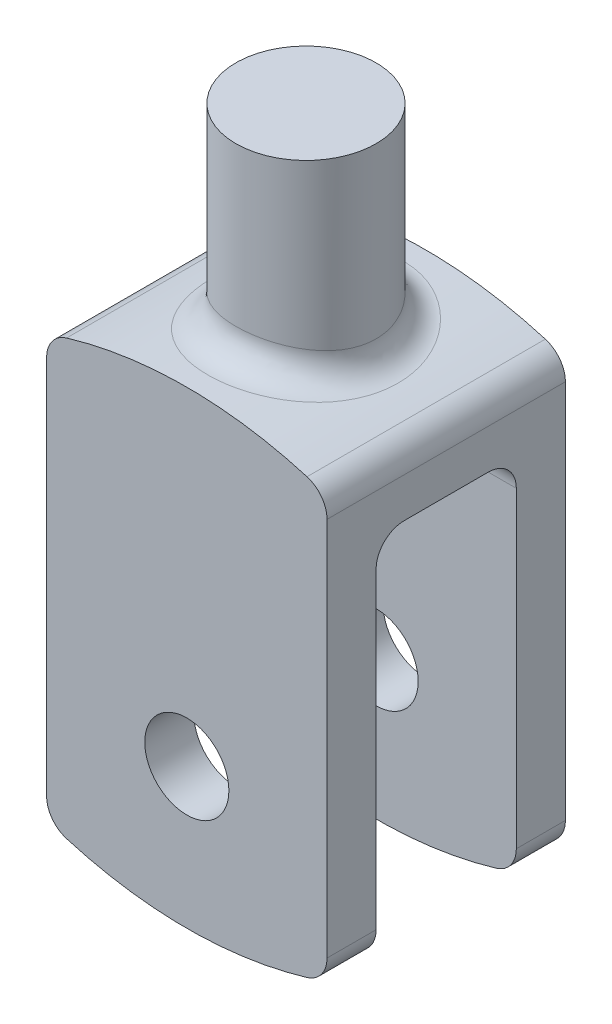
ISO-10303-21;
HEADER;
FILE_DESCRIPTION(('STEP AP214'),'2;1');
FILE_NAME('part.step','',(''),(''),'','','');
FILE_SCHEMA(('AUTOMOTIVE_DESIGN { 1 0 10303 214 1 1 1 1 }'));
ENDSEC;
DATA;
#1=APPLICATION_CONTEXT('core data for automotive mechanical design processes');
#2=APPLICATION_PROTOCOL_DEFINITION('international standard','automotive_design',2000,#1);
#3=PRODUCT_CONTEXT('',#1,'mechanical');
#4=PRODUCT('Part','Part','',(#3));
#5=PRODUCT_RELATED_PRODUCT_CATEGORY('part','',(#4));
#6=PRODUCT_DEFINITION_FORMATION('','',#4);
#7=PRODUCT_DEFINITION_CONTEXT('part definition',#1,'design');
#8=PRODUCT_DEFINITION('design','',#6,#7);
#9=PRODUCT_DEFINITION_SHAPE('','',#8);
#10=(LENGTH_UNIT() NAMED_UNIT(*) SI_UNIT(.MILLI.,.METRE.));
#11=(NAMED_UNIT(*) PLANE_ANGLE_UNIT() SI_UNIT($,.RADIAN.));
#12=(NAMED_UNIT(*) SI_UNIT($,.STERADIAN.) SOLID_ANGLE_UNIT());
#13=UNCERTAINTY_MEASURE_WITH_UNIT(LENGTH_MEASURE(1.E-05),#10,'distance_accuracy_value','');
#14=(GEOMETRIC_REPRESENTATION_CONTEXT(3) GLOBAL_UNCERTAINTY_ASSIGNED_CONTEXT((#13)) GLOBAL_UNIT_ASSIGNED_CONTEXT((#10,
#11,#12)) REPRESENTATION_CONTEXT('',''));
#15=CARTESIAN_POINT('',(0.,0.,0.));
#16=DIRECTION('',(0.,0.,1.));
#17=DIRECTION('',(1.,0.,0.));
#18=AXIS2_PLACEMENT_3D('',#15,#16,#17);
#19=CARTESIAN_POINT('',(0.,-21.2289755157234,10.795));
#20=DIRECTION('',(0.,0.,-1.));
#21=DIRECTION('',(-1.,0.,0.));
#22=AXIS2_PLACEMENT_3D('',#19,#20,#21);
#23=CYLINDRICAL_SURFACE('',#22,38.1);
#24=CARTESIAN_POINT('',(0.,-21.2289755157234,6.35));
#25=DIRECTION('',(0.,0.,1.));
#26=DIRECTION('',(0.,-1.,0.));
#27=AXIS2_PLACEMENT_3D('',#24,#25,#26);
#28=CIRCLE('',#27,38.1);
#29=CARTESIAN_POINT('',(-10.8857142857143,-57.7407712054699,6.34999999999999));
#30=VERTEX_POINT('',#29);
#31=CARTESIAN_POINT('',(10.8857142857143,-57.7407712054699,6.34999999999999));
#32=VERTEX_POINT('',#31);
#33=EDGE_CURVE('E177',#30,#32,#28,.T.);
#34=ORIENTED_EDGE('',*,*,#33,.T.);
#35=DIRECTION('',(0.,0.,-1.));
#36=VECTOR('',#35,1.);
#37=CARTESIAN_POINT('',(10.8857142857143,-57.7407712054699,10.795));
#38=LINE('',#37,#36);
#39=CARTESIAN_POINT('',(10.8857142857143,-57.7407712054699,10.795));
#40=VERTEX_POINT('',#39);
#41=EDGE_CURVE('E293',#32,#40,#38,.F.);
#42=ORIENTED_EDGE('',*,*,#41,.T.);
#43=CARTESIAN_POINT('',(0.,-21.2289755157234,10.795));
#44=DIRECTION('',(0.,0.,1.));
#45=DIRECTION('',(1.,0.,0.));
#46=AXIS2_PLACEMENT_3D('',#43,#44,#45);
#47=CIRCLE('',#46,38.1);
#48=CARTESIAN_POINT('',(-10.8857142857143,-57.7407712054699,10.795));
#49=VERTEX_POINT('',#48);
#50=EDGE_CURVE('E343',#49,#40,#47,.T.);
#51=ORIENTED_EDGE('',*,*,#50,.F.);
#52=DIRECTION('',(0.,0.,-1.));
#53=VECTOR('',#52,1.);
#54=CARTESIAN_POINT('',(-10.8857142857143,-57.7407712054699,10.795));
#55=LINE('',#54,#53);
#56=EDGE_CURVE('E291',#49,#30,#55,.T.);
#57=ORIENTED_EDGE('',*,*,#56,.T.);
#58=EDGE_LOOP('',(#34,#42,#51,#57));
#59=FACE_BOUND('',#58,.T.);
#60=ADVANCED_FACE('F34',(#59),#23,.T.);
#61=CARTESIAN_POINT('',(0.,-54.9710244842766,10.795));
#62=DIRECTION('',(0.,0.,-1.));
#63=DIRECTION('',(-1.,0.,0.));
#64=AXIS2_PLACEMENT_3D('',#61,#62,#63);
#65=CYLINDRICAL_SURFACE('',#64,38.1);
#66=CARTESIAN_POINT('',(-1.62684312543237,-14.3948956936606,6.1380682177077));
#67=CARTESIAN_POINT('',(-1.4957202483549,-16.8950073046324,6.17282122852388));
#68=CARTESIAN_POINT('',(-2.13523160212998,-16.9309037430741,8.59329550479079));
#69=CARTESIAN_POINT('',(-1.28311185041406,-14.3678855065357,6.22917093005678));
#70=CARTESIAN_POINT('',(-1.17403905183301,-16.884578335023,6.25020854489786));
#71=CARTESIAN_POINT('',(-1.68408430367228,-16.905581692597,8.72083930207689));
#72=CARTESIAN_POINT('',(-0.931399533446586,-14.3489130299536,6.29140632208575));
#73=CARTESIAN_POINT('',(-0.851006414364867,-16.8776047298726,6.30155523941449));
#74=CARTESIAN_POINT('',(-1.22246188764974,-16.8877949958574,8.80796885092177));
#75=CARTESIAN_POINT('',(-0.222279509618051,-14.3291852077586,6.35608452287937));
#76=CARTESIAN_POINT('',(-0.20202055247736,-16.8703306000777,6.35511063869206));
#77=CARTESIAN_POINT('',(-0.291741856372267,-16.8693001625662,8.89851833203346));
#78=CARTESIAN_POINT('',(0.13512749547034,-14.3284276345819,6.35853464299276));
#79=CARTESIAN_POINT('',(0.122611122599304,-16.8700589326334,6.3571068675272));
#80=CARTESIAN_POINT('',(0.177354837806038,-16.8685899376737,8.90194850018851));
#81=CARTESIAN_POINT('',(0.838574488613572,-14.3450529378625,6.30408536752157));
#82=CARTESIAN_POINT('',(0.765900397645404,-16.8761788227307,6.31205964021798));
#83=CARTESIAN_POINT('',(1.10062901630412,-16.8841761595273,8.82571951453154));
#84=CARTESIAN_POINT('',(1.18470291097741,-14.3621052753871,6.24826739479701));
#85=CARTESIAN_POINT('',(1.08327757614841,-16.8824248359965,6.2660873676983));
#86=CARTESIAN_POINT('',(1.55492257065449,-16.9001627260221,8.74757435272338));
#87=CARTESIAN_POINT('',(1.86253640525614,-14.4119790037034,6.0807363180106));
#88=CARTESIAN_POINT('',(1.71405910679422,-16.9015111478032,6.12464233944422));
#89=CARTESIAN_POINT('',(2.44457903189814,-16.9469193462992,8.51303084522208));
#90=CARTESIAN_POINT('',(2.19424101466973,-14.4448008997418,5.9690214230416));
#91=CARTESIAN_POINT('',(2.02640546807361,-16.9142827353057,6.02968223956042));
#92=CARTESIAN_POINT('',(2.87994133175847,-16.9776898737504,8.35662999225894));
#93=CARTESIAN_POINT('',(2.83587318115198,-14.5228916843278,5.69236591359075));
#94=CARTESIAN_POINT('',(2.64232534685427,-16.9462641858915,5.78748761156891));
#95=CARTESIAN_POINT('',(3.72208355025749,-17.0508999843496,7.96931227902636));
#96=CARTESIAN_POINT('',(3.14567891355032,-14.5682242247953,5.52715234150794));
#97=CARTESIAN_POINT('',(2.94516922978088,-16.965413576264,5.64072256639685));
#98=CARTESIAN_POINT('',(4.12870357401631,-17.0933992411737,7.73801327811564));
#99=CARTESIAN_POINT('',(3.73350247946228,-14.6664207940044,5.14837403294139));
#100=CARTESIAN_POINT('',(3.53132306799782,-17.0089969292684,5.2941314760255));
#101=CARTESIAN_POINT('',(4.90022200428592,-17.1854585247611,7.20772364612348));
#102=CARTESIAN_POINT('',(4.0115160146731,-14.7192858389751,4.93480277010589));
#103=CARTESIAN_POINT('',(3.81443129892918,-17.0333480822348,5.0950750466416));
#104=CARTESIAN_POINT('',(5.26511476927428,-17.2350195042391,6.90872387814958));
#105=CARTESIAN_POINT('',(4.53400993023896,-14.8280650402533,4.46009153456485));
#106=CARTESIAN_POINT('',(4.35579928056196,-17.0855786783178,4.64097369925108));
#107=CARTESIAN_POINT('',(5.95088803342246,-17.3370000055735,6.24412814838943));
#108=CARTESIAN_POINT('',(4.77766830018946,-14.884019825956,4.19805089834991));
#109=CARTESIAN_POINT('',(4.61377965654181,-17.1134889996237,4.38541327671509));
#110=CARTESIAN_POINT('',(6.27068964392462,-17.3894576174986,5.87727125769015));
#111=CARTESIAN_POINT('',(5.21779402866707,-14.9917051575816,3.63653478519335));
#112=CARTESIAN_POINT('',(5.08607964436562,-17.1689332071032,3.82607928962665));
#113=CARTESIAN_POINT('',(6.84835466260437,-17.4904126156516,5.09114869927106));
#114=CARTESIAN_POINT('',(5.41425931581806,-15.0434355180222,3.33705766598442));
#115=CARTESIAN_POINT('',(5.30109492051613,-17.1964995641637,3.52251692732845));
#116=CARTESIAN_POINT('',(7.10621535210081,-17.5389098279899,4.67188073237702));
#117=CARTESIAN_POINT('',(5.75528848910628,-15.1370239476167,2.70704732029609));
#118=CARTESIAN_POINT('',(5.67746421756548,-17.2474027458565,2.87432718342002));
#119=CARTESIAN_POINT('',(7.55381614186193,-17.6266489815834,3.7898662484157));
#120=CARTESIAN_POINT('',(5.89957361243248,-15.1788285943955,2.37635885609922));
#121=CARTESIAN_POINT('',(5.83941099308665,-17.2708089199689,2.52915588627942));
#122=CARTESIAN_POINT('',(7.74319036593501,-17.6658408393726,3.32690239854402));
#123=CARTESIAN_POINT('',(6.1302689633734,-15.2472291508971,1.6946223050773));
#124=CARTESIAN_POINT('',(6.09920172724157,-17.3094878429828,1.81125495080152));
#125=CARTESIAN_POINT('',(8.04597801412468,-17.7299663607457,2.37247122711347));
#126=CARTESIAN_POINT('',(6.21668791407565,-15.2738273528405,1.34357729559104));
#127=CARTESIAN_POINT('',(6.19782695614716,-17.3248678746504,1.43767778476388));
#128=CARTESIAN_POINT('',(8.15940288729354,-17.7549021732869,1.88100821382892));
#129=CARTESIAN_POINT('',(6.32770988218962,-15.3082251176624,0.638374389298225));
#130=CARTESIAN_POINT('',(6.32434369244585,-17.3447650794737,0.684883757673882));
#131=CARTESIAN_POINT('',(8.30511922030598,-17.7871500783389,0.893724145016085));
#132=CARTESIAN_POINT('',(6.35347907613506,-15.3163792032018,0.284408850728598));
#133=CARTESIAN_POINT('',(6.35397829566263,-17.3495505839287,0.304766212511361));
#134=CARTESIAN_POINT('',(8.33894128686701,-17.7947945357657,0.398172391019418));
#135=CARTESIAN_POINT('',(6.34576662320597,-15.3139584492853,-0.422823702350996));
#136=CARTESIAN_POINT('',(6.34515813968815,-17.3481408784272,-0.453200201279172));
#137=CARTESIAN_POINT('',(8.32881869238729,-17.7925250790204,-0.591953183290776));
#138=CARTESIAN_POINT('',(6.31228993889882,-15.3033851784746,-0.776090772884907));
#139=CARTESIAN_POINT('',(6.30667936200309,-17.341941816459,-0.832326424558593));
#140=CARTESIAN_POINT('',(8.28488054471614,-17.7826126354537,-1.08652708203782));
#141=CARTESIAN_POINT('',(6.1880838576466,-15.2650529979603,-1.4668264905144));
#142=CARTESIAN_POINT('',(6.16529913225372,-17.31981501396,-1.5687562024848));
#143=CARTESIAN_POINT('',(8.12186006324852,-17.7466762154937,-2.0535570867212));
#144=CARTESIAN_POINT('',(6.0981515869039,-15.2375334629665,-1.80444594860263));
#145=CARTESIAN_POINT('',(6.06285035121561,-17.3039544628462,-1.92739477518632));
#146=CARTESIAN_POINT('',(8.00382395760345,-17.7208766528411,-2.52622432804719));
#147=CARTESIAN_POINT('',(5.86455796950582,-15.1686756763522,-2.45977497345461));
#148=CARTESIAN_POINT('',(5.80019918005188,-17.2651311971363,-2.61625695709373));
#149=CARTESIAN_POINT('',(7.69723233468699,-17.6563224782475,-3.44368496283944));
#150=CARTESIAN_POINT('',(5.72089305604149,-15.1273365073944,-2.77748321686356));
#151=CARTESIAN_POINT('',(5.63927681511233,-17.2420713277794,-2.94720684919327));
#152=CARTESIAN_POINT('',(7.50867213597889,-17.6175670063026,-3.88847650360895));
#153=CARTESIAN_POINT('',(5.38169706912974,-15.0348021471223,-3.3887567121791));
#154=CARTESIAN_POINT('',(5.2654646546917,-17.1918848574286,-3.57507096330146));
#155=CARTESIAN_POINT('',(7.06347740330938,-17.5308160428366,-4.74425939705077));
#156=CARTESIAN_POINT('',(5.18549065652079,-14.9834811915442,-3.68193722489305));
#157=CARTESIAN_POINT('',(5.05110760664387,-17.164627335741,-3.87169541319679));
#158=CARTESIAN_POINT('',(6.80595648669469,-17.4827026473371,-5.15471211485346));
#159=CARTESIAN_POINT('',(4.74750174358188,-14.8770074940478,-4.23170049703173));
#160=CARTESIAN_POINT('',(4.58180259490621,-17.1099680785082,-4.418377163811));
#161=CARTESIAN_POINT('',(6.23109603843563,-17.3828835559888,-5.92438069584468));
#162=CARTESIAN_POINT('',(4.50570710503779,-14.8218537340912,-4.48827347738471));
#163=CARTESIAN_POINT('',(4.32619077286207,-17.0825384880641,-4.66819493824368));
#164=CARTESIAN_POINT('',(5.91374057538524,-17.3311769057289,-6.28358286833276));
#165=CARTESIAN_POINT('',(3.97766330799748,-14.7125960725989,-4.96278342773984));
#166=CARTESIAN_POINT('',(3.77962543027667,-17.0301988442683,-5.12155272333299));
#167=CARTESIAN_POINT('',(5.22068309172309,-17.2287478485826,-6.94789679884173));
#168=CARTESIAN_POINT('',(3.69061926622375,-14.658535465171,-5.17984151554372));
#169=CARTESIAN_POINT('',(3.48783646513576,-17.0053972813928,-5.32337226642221));
#170=CARTESIAN_POINT('',(4.84393778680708,-17.1780660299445,-7.2517781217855));
#171=CARTESIAN_POINT('',(3.08362598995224,-14.5587142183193,-5.5625791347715));
#172=CARTESIAN_POINT('',(2.88399037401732,-16.9613054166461,-5.67265081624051));
#173=CARTESIAN_POINT('',(4.04725911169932,-17.0844836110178,-7.78761078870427));
#174=CARTESIAN_POINT('',(2.76370108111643,-14.5129475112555,-5.72829628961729));
#175=CARTESIAN_POINT('',(2.57219385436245,-16.9421030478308,-5.81930777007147));
#176=CARTESIAN_POINT('',(3.62735766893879,-17.0415773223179,-8.01961480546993));
#177=CARTESIAN_POINT('',(2.16993709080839,-14.4430536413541,-5.97447646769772));
#178=CARTESIAN_POINT('',(2.00439305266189,-16.913688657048,-6.03386817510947));
#179=CARTESIAN_POINT('',(2.84804243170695,-16.9760518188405,-8.36426705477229));
#180=CARTESIAN_POINT('',(1.90059279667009,-14.4163987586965,-6.06554598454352));
#181=CARTESIAN_POINT('',(1.75051482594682,-16.9032608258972,-6.11156128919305));
#182=CARTESIAN_POINT('',(2.49452804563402,-16.9510628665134,-8.4917643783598));
#183=CARTESIAN_POINT('',(1.35176063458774,-14.3732879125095,-6.21094362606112));
#184=CARTESIAN_POINT('',(1.23846006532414,-16.886673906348,-6.2346740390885));
#185=CARTESIAN_POINT('',(1.77418583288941,-16.9106464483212,-8.69532107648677));
#186=CARTESIAN_POINT('',(1.07227335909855,-14.3568313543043,-6.26527389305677));
#187=CARTESIAN_POINT('',(0.980833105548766,-16.8805534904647,-6.27980384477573));
#188=CARTESIAN_POINT('',(1.40735878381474,-16.8952184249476,-8.77138345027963));
#189=CARTESIAN_POINT('',(0.442660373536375,-14.3328435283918,-6.34421767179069));
#190=CARTESIAN_POINT('',(0.403036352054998,-16.8716518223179,-6.34540443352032));
#191=CARTESIAN_POINT('',(0.580991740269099,-16.87272983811,-8.88190474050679));
#192=CARTESIAN_POINT('',(0.0911985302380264,-14.3282711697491,-6.35900438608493));
#193=CARTESIAN_POINT('',(0.0835434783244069,-16.870012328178,-6.3574476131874));
#194=CARTESIAN_POINT('',(0.119698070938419,-16.8684432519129,-8.90260614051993));
#195=CARTESIAN_POINT('',(-0.60937489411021,-14.337015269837,-6.3304200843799));
#196=CARTESIAN_POINT('',(-0.55615695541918,-16.8732209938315,-6.33383619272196));
#197=CARTESIAN_POINT('',(-0.799804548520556,-16.8766408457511,-8.86258811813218));
#198=CARTESIAN_POINT('',(-0.958484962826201,-14.3503423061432,-6.28701468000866));
#199=CARTESIAN_POINT('',(-0.875077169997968,-16.8780601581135,-6.29824777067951));
#200=CARTESIAN_POINT('',(-1.25801151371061,-16.8891349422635,-8.80182055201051));
#201=CARTESIAN_POINT('',(-1.64401986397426,-14.3934107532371,-6.1434707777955));
#202=CARTESIAN_POINT('',(-1.5097350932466,-16.8943539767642,-6.17778507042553));
#203=CARTESIAN_POINT('',(-2.15777607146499,-16.9295116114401,-8.60085908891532));
#204=CARTESIAN_POINT('',(-1.98045393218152,-14.4231399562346,-6.04337447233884));
#205=CARTESIAN_POINT('',(-1.82434704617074,-16.9057428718,-6.09339903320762));
#206=CARTESIAN_POINT('',(-2.59934578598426,-16.957382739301,-8.46072426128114));
#207=CARTESIAN_POINT('',(-2.63162249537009,-14.4957842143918,-5.78957744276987));
#208=CARTESIAN_POINT('',(-2.44476217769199,-16.9350164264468,-5.873144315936));
#209=CARTESIAN_POINT('',(-3.45400452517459,-17.0254867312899,-8.10540841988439));
#210=CARTESIAN_POINT('',(-2.94635733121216,-14.538699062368,-5.63587756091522));
#211=CARTESIAN_POINT('',(-2.74978639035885,-16.9528099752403,-5.73798166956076));
#212=CARTESIAN_POINT('',(-3.8670939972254,-17.0657194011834,-7.89022858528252));
#213=CARTESIAN_POINT('',(-3.54910042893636,-14.6336518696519,-5.27737322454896));
#214=CARTESIAN_POINT('',(-3.34571445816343,-16.9942129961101,-5.41316926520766));
#215=CARTESIAN_POINT('',(-4.65819431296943,-17.1547376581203,-7.38832251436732));
#216=CARTESIAN_POINT('',(-3.83678348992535,-14.6857833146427,-5.07203499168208));
#217=CARTESIAN_POINT('',(-3.63614701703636,-17.0177944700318,-5.2237329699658));
#218=CARTESIAN_POINT('',(-5.03577833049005,-17.2036108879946,-7.10084898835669));
#219=CARTESIAN_POINT('',(-4.37404121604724,-14.7932317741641,-4.61673983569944));
#220=CARTESIAN_POINT('',(-4.1885367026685,-17.0685807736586,-4.79207999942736));
#221=CARTESIAN_POINT('',(-5.74092909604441,-17.304343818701,-6.46343576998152));
#222=CARTESIAN_POINT('',(-4.62361089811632,-14.8485492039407,-4.36677708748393));
#223=CARTESIAN_POINT('',(-4.450686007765,-17.095736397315,-4.55051709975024));
#224=CARTESIAN_POINT('',(-6.0684893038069,-17.3562039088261,-6.11348792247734));
#225=CARTESIAN_POINT('',(-5.08225498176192,-14.9573722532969,-3.82384001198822));
#226=CARTESIAN_POINT('',(-4.93934427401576,-17.1509844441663,-4.01413593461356));
#227=CARTESIAN_POINT('',(-6.67045966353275,-17.4582255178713,-5.35337601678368));
#228=CARTESIAN_POINT('',(-5.29050152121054,-15.0108259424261,-3.53016008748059));
#229=CARTESIAN_POINT('',(-5.16579148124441,-17.1791074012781,-3.71868763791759));
#230=CARTESIAN_POINT('',(-6.94378324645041,-17.5083383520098,-4.9422241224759));
#231=CARTESIAN_POINT('',(-5.65471667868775,-15.1087029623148,-2.91128373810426));
#232=CARTESIAN_POINT('',(-5.5656298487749,-17.2317980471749,-3.08582065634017));
#233=CARTESIAN_POINT('',(-7.42181564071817,-17.6000980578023,-4.07579723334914));
#234=CARTESIAN_POINT('',(-5.81068745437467,-15.1531266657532,-2.58608861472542));
#235=CARTESIAN_POINT('',(-5.73988558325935,-17.2564478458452,-2.74819986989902));
#236=CARTESIAN_POINT('',(-7.62652728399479,-17.6417452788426,-3.62052406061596));
#237=CARTESIAN_POINT('',(-6.06483509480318,-15.2274778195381,-1.91524107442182));
#238=CARTESIAN_POINT('',(-6.02507866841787,-17.2982068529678,-2.04463987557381));
#239=CARTESIAN_POINT('',(-7.96009606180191,-17.7114494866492,-2.68133750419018));
#240=CARTESIAN_POINT('',(-6.16334962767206,-15.2574897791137,-1.56972159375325));
#241=CARTESIAN_POINT('',(-6.1371841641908,-17.3154651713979,-1.6781574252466));
#242=CARTESIAN_POINT('',(-8.0893963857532,-17.7395857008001,-2.19761023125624));
#243=CARTESIAN_POINT('',(-6.30079046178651,-15.2997809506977,-0.866507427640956));
#244=CARTESIAN_POINT('',(-6.2935075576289,-17.3398402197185,-0.92910150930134));
#245=CARTESIAN_POINT('',(-8.26978748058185,-17.7792336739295,-1.21311039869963));
#246=CARTESIAN_POINT('',(-6.33972645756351,-15.3120630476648,-0.508814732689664));
#247=CARTESIAN_POINT('',(-6.33824862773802,-17.347036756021,-0.545382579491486));
#248=CARTESIAN_POINT('',(-8.32089097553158,-17.7907481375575,-0.712340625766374));
#249=CARTESIAN_POINT('',(-6.35652661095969,-15.3173355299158,0.20024044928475));
#250=CARTESIAN_POINT('',(-6.35746201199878,-17.3501072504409,0.214484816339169));
#251=CARTESIAN_POINT('',(-8.34294117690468,-17.7956910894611,0.280336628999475));
#252=CARTESIAN_POINT('',(-6.33570394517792,-15.310740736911,0.551570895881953));
#253=CARTESIAN_POINT('',(-6.33351009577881,-17.3462350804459,0.591869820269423));
#254=CARTESIAN_POINT('',(-8.31561142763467,-17.7895084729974,0.772199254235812));
#255=CARTESIAN_POINT('',(-6.2364965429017,-15.2799354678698,1.24558655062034));
#256=CARTESIAN_POINT('',(-6.22039299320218,-17.3283959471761,1.33321936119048));
#257=CARTESIAN_POINT('',(-8.18540171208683,-17.7606285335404,1.74382117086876));
#258=CARTESIAN_POINT('',(-6.15811235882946,-15.2557251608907,1.58827184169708));
#259=CARTESIAN_POINT('',(-6.13086466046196,-17.3143722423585,1.69833566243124));
#260=CARTESIAN_POINT('',(-8.08252247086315,-17.7379313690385,2.22358057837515));
#261=CARTESIAN_POINT('',(-5.94662075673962,-15.192611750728,2.25431027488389));
#262=CARTESIAN_POINT('',(-5.89228968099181,-17.2785644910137,2.40109094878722));
#263=CARTESIAN_POINT('',(-7.80493974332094,-17.67876254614,3.15603438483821));
#264=CARTESIAN_POINT('',(-5.81369199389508,-15.1537566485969,2.57772261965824));
#265=CARTESIAN_POINT('',(-5.7427567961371,-17.2567104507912,2.73964589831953));
#266=CARTESIAN_POINT('',(-7.63047074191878,-17.6423358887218,3.60881166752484));
#267=CARTESIAN_POINT('',(-5.49703879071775,-15.0657080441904,3.19786125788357));
#268=CARTESIAN_POINT('',(-5.39210241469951,-17.2085056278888,3.38016842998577));
#269=CARTESIAN_POINT('',(-7.21486341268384,-17.559790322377,4.47700576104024));
#270=CARTESIAN_POINT('',(-5.3133080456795,-15.0165132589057,3.49458423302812));
#271=CARTESIAN_POINT('',(-5.19017666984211,-17.1820662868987,3.68249596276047));
#272=CARTESIAN_POINT('',(-6.97371680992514,-17.513670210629,4.89241792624));
#273=CARTESIAN_POINT('',(-4.89585436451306,-14.9120773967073,4.0594248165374));
#274=CARTESIAN_POINT('',(-4.73980371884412,-17.1277320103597,4.24860951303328));
#275=CARTESIAN_POINT('',(-6.42580885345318,-17.4157615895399,5.68319474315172));
#276=CARTESIAN_POINT('',(-4.66118941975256,-14.8567335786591,4.32683670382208));
#277=CARTESIAN_POINT('',(-4.48981638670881,-17.0997811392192,4.51130039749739));
#278=CARTESIAN_POINT('',(-6.11781111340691,-17.363876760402,6.0575713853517));
#279=CARTESIAN_POINT('',(-4.15050406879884,-14.7469537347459,4.81887583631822));
#280=CARTESIAN_POINT('',(-3.95718338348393,-17.0463720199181,4.98557171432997));
#281=CARTESIAN_POINT('',(-5.44753659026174,-17.2609581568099,6.74642617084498));
#282=CARTESIAN_POINT('',(-3.87448000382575,-14.6925177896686,5.04349929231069));
#283=CARTESIAN_POINT('',(-3.67415630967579,-17.0209404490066,5.19658907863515));
#284=CARTESIAN_POINT('',(-5.08525500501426,-17.2099244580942,7.06089900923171));
#285=CARTESIAN_POINT('',(-3.28469071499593,-14.5898689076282,5.44631927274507));
#286=CARTESIAN_POINT('',(-3.08225507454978,-16.9747731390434,5.56793317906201));
#287=CARTESIAN_POINT('',(-4.31115656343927,-17.1136911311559,7.62484698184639));
#288=CARTESIAN_POINT('',(-2.97049739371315,-14.5417421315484,5.62390127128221));
#289=CARTESIAN_POINT('',(-2.77326873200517,-16.9541874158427,5.72674765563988));
#290=CARTESIAN_POINT('',(-3.89877782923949,-17.0685722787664,7.87346177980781));
#291=CARTESIAN_POINT('',(-2.315885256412,-14.4579535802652,5.92357284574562));
#292=CARTESIAN_POINT('',(-2.14181019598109,-16.9195100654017,5.99059357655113));
#293=CARTESIAN_POINT('',(-3.03959939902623,-16.9900205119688,8.29300198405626));
#294=CARTESIAN_POINT('',(-1.97546917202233,-14.4222905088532,6.04566819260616));
#295=CARTESIAN_POINT('',(-1.82002300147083,-16.9055212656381,6.09480324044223));
#296=CARTESIAN_POINT('',(-2.59280328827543,-16.9565863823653,8.46393546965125));
#297=CARTESIAN_POINT('',(-1.62684312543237,-14.3948956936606,6.1380682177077));
#298=CARTESIAN_POINT('',(-1.4957202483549,-16.8950073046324,6.17282122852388));
#299=CARTESIAN_POINT('',(-2.13523160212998,-16.9309037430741,8.59329550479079));
#300=(BOUNDED_SURFACE() B_SPLINE_SURFACE(3,2,((#66,#67,#68),(#69,#70,#71),(#72,#73,#74),(#75,
#76,#77),(#78,#79,#80),(#81,#82,#83),(#84,#85,#86),(#87,#88,#89),(#90,#91,#92),(#93,#94,#95),
(#96,#97,#98),(#99,#100,#101),(#102,#103,#104),(#105,#106,#107),(#108,#109,#110),(#111,#112,
#113),(#114,#115,#116),(#117,#118,#119),(#120,#121,#122),(#123,#124,#125),(#126,#127,#128),
(#129,#130,#131),(#132,#133,#134),(#135,#136,#137),(#138,#139,#140),(#141,#142,#143),(#144,#145,
#146),(#147,#148,#149),(#150,#151,#152),(#153,#154,#155),(#156,#157,#158),(#159,#160,#161),
(#162,#163,#164),(#165,#166,#167),(#168,#169,#170),(#171,#172,#173),(#174,#175,#176),(#177,#178,
#179),(#180,#181,#182),(#183,#184,#185),(#186,#187,#188),(#189,#190,#191),(#192,#193,#194),
(#195,#196,#197),(#198,#199,#200),(#201,#202,#203),(#204,#205,#206),(#207,#208,#209),(#210,#211,
#212),(#213,#214,#215),(#216,#217,#218),(#219,#220,#221),(#222,#223,#224),(#225,#226,#227),
(#228,#229,#230),(#231,#232,#233),(#234,#235,#236),(#237,#238,#239),(#240,#241,#242),(#243,#244,
#245),(#246,#247,#248),(#249,#250,#251),(#252,#253,#254),(#255,#256,#257),(#258,#259,#260),
(#261,#262,#263),(#264,#265,#266),(#267,#268,#269),(#270,#271,#272),(#273,#274,#275),(#276,#277,
#278),(#279,#280,#281),(#282,#283,#284),(#285,#286,#287),(#288,#289,#290),(#291,#292,#293),
(#294,#295,#296),(#297,#298,#299)),.UNSPECIFIED.,.T.,.F.,.F.) B_SPLINE_SURFACE_WITH_KNOTS((4,2,
2,2,2,2,2,2,2,2,2,2,2,2,2,2,2,2,2,2,2,2,2,2,2,2,2,2,2,2,2,2,2,2,2,2,2,2,4),(3,3),(0.,
1.49388668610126,2.98759067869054,4.45405700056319,5.92057031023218,7.39468708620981,
8.86900292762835,10.3741231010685,11.8793093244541,13.3924219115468,14.9053063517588,
16.3888544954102,17.8722783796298,19.3352140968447,20.7982469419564,22.2810712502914,
23.7642909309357,25.2772821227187,26.7891619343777,27.9824517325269,29.1756719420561,
30.6458981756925,32.1169936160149,33.5869956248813,35.0569745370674,36.5428223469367,
38.0288642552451,39.542197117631,41.0554675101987,42.5597524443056,44.0637925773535,
45.5350366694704,47.0062666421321,48.4727157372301,49.9393469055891,51.4358500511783,
52.9324856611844,54.4478030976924,55.9629628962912),(0.,1.),
.UNSPECIFIED.) GEOMETRIC_REPRESENTATION_ITEM() RATIONAL_B_SPLINE_SURFACE(((1.,0.712164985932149,
1.),(1.,0.710035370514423,1.),(1.,0.708528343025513,1.),(1.,0.706961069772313,1.),(1.,
0.706900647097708,1.),(1.,0.708221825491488,1.),(1.,0.709577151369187,1.),(1.,0.713513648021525,
1.),(1.,0.716094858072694,1.),(1.,0.722179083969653,1.),(1.,0.725686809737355,1.),(1.,
0.733204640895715,1.),(1.,0.737214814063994,1.),(1.,0.745378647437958,1.),(1.,0.749533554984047,
1.),(1.,0.757451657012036,1.),(1.,0.761214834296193,1.),(1.,0.767970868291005,1.),(1.,
0.770959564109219,1.),(1.,0.775826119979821,1.),(1.,0.777704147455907,1.),(1.,0.780129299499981,
1.),(1.,0.78070152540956,1.),(1.,0.780531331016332,1.),(1.,0.779789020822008,1.),(1.,
0.777084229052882,1.),(1.,0.77513874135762,1.),(1.,0.770234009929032,1.),(1.,0.767274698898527,
1.),(1.,0.760587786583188,1.),(1.,0.75685033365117,1.),(1.,0.749014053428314,1.),(1.,
0.744915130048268,1.),(1.,0.736709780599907,1.),(1.,0.73260485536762,1.),(1.,0.724954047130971,
1.),(1.,0.721407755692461,1.),(1.,0.715955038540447,1.),(1.,0.713860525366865,1.),(1.,
0.710461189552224,1.),(1.,0.709156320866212,1.),(1.,0.707252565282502,1.),(1.,0.706887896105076,
1.),(1.,0.707583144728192,1.),(1.,0.708643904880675,1.),(1.,0.712050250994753,1.),(1.,
0.714394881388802,1.),(1.,0.720073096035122,1.),(1.,0.723406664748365,1.),(1.,0.730705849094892,
1.),(1.,0.734677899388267,1.),(1.,0.742776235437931,1.),(1.,0.746902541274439,1.),(1.,
0.754939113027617,1.),(1.,0.758844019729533,1.),(1.,0.765935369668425,1.),(1.,0.769121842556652,
1.),(1.,0.774425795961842,1.),(1.,0.776549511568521,1.),(1.,0.779535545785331,1.),(1.,
0.780398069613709,1.),(1.,0.780768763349,1.),(1.,0.780306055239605,1.),(1.,0.778135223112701,
1.),(1.,0.776427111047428,1.),(1.,0.771942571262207,1.),(1.,0.769169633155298,1.),(1.,
0.762828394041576,1.),(1.,0.759259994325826,1.),(1.,0.751606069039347,1.),(1.,0.747511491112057,
1.),(1.,0.73930222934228,1.),(1.,0.735187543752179,1.),(1.,0.727353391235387,1.),(1.,
0.723639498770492,1.),(1.,0.717125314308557,1.),(1.,0.714324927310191,1.),(1.,0.712164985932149,1.))) REPRESENTATION_ITEM('') SURFACE());
#301=CARTESIAN_POINT('',(-2.13523160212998,-16.9309037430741,8.59329550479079));
#302=CARTESIAN_POINT('',(-2.59280328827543,-16.9565863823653,8.46393546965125));
#303=CARTESIAN_POINT('',(-3.03959939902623,-16.9900205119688,8.29300198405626));
#304=CARTESIAN_POINT('',(-3.89877782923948,-17.0685722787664,7.87346177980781));
#305=CARTESIAN_POINT('',(-4.31115656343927,-17.1136911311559,7.62484698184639));
#306=CARTESIAN_POINT('',(-5.08525500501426,-17.2099244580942,7.06089900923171));
#307=CARTESIAN_POINT('',(-5.44753659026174,-17.2609581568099,6.74642617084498));
#308=CARTESIAN_POINT('',(-6.11781111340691,-17.363876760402,6.0575713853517));
#309=CARTESIAN_POINT('',(-6.42580885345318,-17.4157615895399,5.68319474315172));
#310=CARTESIAN_POINT('',(-6.97371680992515,-17.513670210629,4.89241792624));
#311=CARTESIAN_POINT('',(-7.21486341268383,-17.559790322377,4.47700576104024));
#312=CARTESIAN_POINT('',(-7.63047074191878,-17.6423358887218,3.60881166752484));
#313=CARTESIAN_POINT('',(-7.80493974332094,-17.67876254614,3.15603438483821));
#314=CARTESIAN_POINT('',(-8.08252247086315,-17.7379313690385,2.22358057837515));
#315=CARTESIAN_POINT('',(-8.18540171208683,-17.7606285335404,1.74382117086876));
#316=CARTESIAN_POINT('',(-8.31561142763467,-17.7895084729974,0.772199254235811));
#317=CARTESIAN_POINT('',(-8.34294117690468,-17.7956910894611,0.280336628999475));
#318=CARTESIAN_POINT('',(-8.32089097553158,-17.7907481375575,-0.712340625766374));
#319=CARTESIAN_POINT('',(-8.26978748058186,-17.7792336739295,-1.21311039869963));
#320=CARTESIAN_POINT('',(-8.0893963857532,-17.7395857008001,-2.19761023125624));
#321=CARTESIAN_POINT('',(-7.96009606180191,-17.7114494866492,-2.68133750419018));
#322=CARTESIAN_POINT('',(-7.62652728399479,-17.6417452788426,-3.62052406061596));
#323=CARTESIAN_POINT('',(-7.42181564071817,-17.6000980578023,-4.07579723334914));
#324=CARTESIAN_POINT('',(-6.94378324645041,-17.5083383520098,-4.9422241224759));
#325=CARTESIAN_POINT('',(-6.67045966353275,-17.4582255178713,-5.35337601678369));
#326=CARTESIAN_POINT('',(-6.0684893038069,-17.3562039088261,-6.11348792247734));
#327=CARTESIAN_POINT('',(-5.74092909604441,-17.304343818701,-6.46343576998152));
#328=CARTESIAN_POINT('',(-5.03577833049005,-17.2036108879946,-7.10084898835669));
#329=CARTESIAN_POINT('',(-4.65819431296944,-17.1547376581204,-7.38832251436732));
#330=CARTESIAN_POINT('',(-3.8670939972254,-17.0657194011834,-7.89022858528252));
#331=CARTESIAN_POINT('',(-3.45400452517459,-17.0254867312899,-8.10540841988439));
#332=CARTESIAN_POINT('',(-2.59934578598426,-16.957382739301,-8.46072426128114));
#333=CARTESIAN_POINT('',(-2.15777607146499,-16.9295116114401,-8.60085908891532));
#334=CARTESIAN_POINT('',(-1.25801151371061,-16.8891349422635,-8.80182055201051));
#335=CARTESIAN_POINT('',(-0.799804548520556,-16.8766408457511,-8.86258811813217));
#336=CARTESIAN_POINT('',(0.119698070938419,-16.8684432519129,-8.90260614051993));
#337=CARTESIAN_POINT('',(0.580991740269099,-16.87272983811,-8.88190474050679));
#338=CARTESIAN_POINT('',(1.40735878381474,-16.8952184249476,-8.77138345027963));
#339=CARTESIAN_POINT('',(1.77418583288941,-16.9106464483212,-8.69532107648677));
#340=CARTESIAN_POINT('',(2.49452804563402,-16.9510628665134,-8.4917643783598));
#341=CARTESIAN_POINT('',(2.84804243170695,-16.9760518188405,-8.36426705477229));
#342=CARTESIAN_POINT('',(3.62735766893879,-17.0415773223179,-8.01961480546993));
#343=CARTESIAN_POINT('',(4.04725911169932,-17.0844836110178,-7.78761078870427));
#344=CARTESIAN_POINT('',(4.84393778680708,-17.1780660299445,-7.2517781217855));
#345=CARTESIAN_POINT('',(5.22068309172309,-17.2287478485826,-6.94789679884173));
#346=CARTESIAN_POINT('',(5.91374057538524,-17.3311769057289,-6.28358286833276));
#347=CARTESIAN_POINT('',(6.23109603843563,-17.3828835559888,-5.92438069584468));
#348=CARTESIAN_POINT('',(6.80595648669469,-17.4827026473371,-5.15471211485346));
#349=CARTESIAN_POINT('',(7.06347740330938,-17.5308160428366,-4.74425939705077));
#350=CARTESIAN_POINT('',(7.50867213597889,-17.6175670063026,-3.88847650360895));
#351=CARTESIAN_POINT('',(7.69723233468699,-17.6563224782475,-3.44368496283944));
#352=CARTESIAN_POINT('',(8.00382395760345,-17.7208766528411,-2.52622432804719));
#353=CARTESIAN_POINT('',(8.12186006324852,-17.7466762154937,-2.0535570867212));
#354=CARTESIAN_POINT('',(8.28488054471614,-17.7826126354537,-1.08652708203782));
#355=CARTESIAN_POINT('',(8.32881869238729,-17.7925250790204,-0.591953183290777));
#356=CARTESIAN_POINT('',(8.33894128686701,-17.7947945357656,0.398172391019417));
#357=CARTESIAN_POINT('',(8.30511922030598,-17.7871500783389,0.893724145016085));
#358=CARTESIAN_POINT('',(8.15940288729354,-17.7549021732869,1.88100821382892));
#359=CARTESIAN_POINT('',(8.04597801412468,-17.7299663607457,2.37247122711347));
#360=CARTESIAN_POINT('',(7.74319036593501,-17.6658408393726,3.32690239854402));
#361=CARTESIAN_POINT('',(7.55381614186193,-17.6266489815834,3.7898662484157));
#362=CARTESIAN_POINT('',(7.10621535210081,-17.5389098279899,4.67188073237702));
#363=CARTESIAN_POINT('',(6.84835466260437,-17.4904126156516,5.09114869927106));
#364=CARTESIAN_POINT('',(6.27068964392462,-17.3894576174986,5.87727125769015));
#365=CARTESIAN_POINT('',(5.95088803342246,-17.3370000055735,6.24412814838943));
#366=CARTESIAN_POINT('',(5.26511476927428,-17.2350195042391,6.90872387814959));
#367=CARTESIAN_POINT('',(4.90022200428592,-17.1854585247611,7.20772364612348));
#368=CARTESIAN_POINT('',(4.12870357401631,-17.0933992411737,7.73801327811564));
#369=CARTESIAN_POINT('',(3.7220835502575,-17.0508999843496,7.96931227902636));
#370=CARTESIAN_POINT('',(2.87994133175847,-16.9776898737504,8.35662999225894));
#371=CARTESIAN_POINT('',(2.44457903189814,-16.9469193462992,8.51303084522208));
#372=CARTESIAN_POINT('',(1.55492257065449,-16.9001627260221,8.74757435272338));
#373=CARTESIAN_POINT('',(1.10062901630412,-16.8841761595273,8.82571951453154));
#374=CARTESIAN_POINT('',(0.177354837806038,-16.8685899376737,8.90194850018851));
#375=CARTESIAN_POINT('',(-0.291741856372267,-16.8693001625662,8.89851833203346));
#376=CARTESIAN_POINT('',(-1.22246188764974,-16.8877949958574,8.80796885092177));
#377=CARTESIAN_POINT('',(-1.68408430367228,-16.905581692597,8.72083930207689));
#378=CARTESIAN_POINT('',(-2.13523160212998,-16.9309037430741,8.59329550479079));
#379=B_SPLINE_CURVE_WITH_KNOTS('',3,(#301,#302,#303,#304,#305,#306,#307,#308,#309,#310,#311,
#312,#313,#314,#315,#316,#317,#318,#319,#320,#321,#322,#323,#324,#325,#326,#327,#328,#329,#330,
#331,#332,#333,#334,#335,#336,#337,#338,#339,#340,#341,#342,#343,#344,#345,#346,#347,#348,#349,
#350,#351,#352,#353,#354,#355,#356,#357,#358,#359,#360,#361,#362,#363,#364,#365,#366,#367,#368,
#369,#370,#371,#372,#373,#374,#375,#376,#377,#378),.UNSPECIFIED.,.T.,.F.,(4,2,2,2,2,2,2,2,2,2,2,
2,2,2,2,2,2,2,2,2,2,2,2,2,2,2,2,2,2,2,2,2,2,2,2,2,2,2,4),(0.,1.51515979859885,3.03047723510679,
4.52711284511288,6.02361599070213,7.4902471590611,8.95669625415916,10.4279262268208,
11.8991703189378,13.4032104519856,14.9074953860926,16.4207657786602,17.9340986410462,
19.4201405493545,20.9059883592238,22.3759672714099,23.8459692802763,25.3170647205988,
26.7872909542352,27.9805111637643,29.1738009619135,30.6856807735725,32.1986719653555,
33.6818916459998,35.1647159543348,36.6277487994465,38.0906845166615,39.574108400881,
41.0576565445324,42.5705409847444,44.0836535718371,45.5888397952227,47.0939599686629,
48.5682758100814,50.042392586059,51.508905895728,52.9753722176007,54.46907621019,
55.9629628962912),.UNSPECIFIED.);
#380=CARTESIAN_POINT('',(-2.13523160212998,-16.9309037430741,8.59329550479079));
#381=VERTEX_POINT('',#380);
#382=EDGE_CURVE('E198',#381,#381,#379,.T.);
#383=ORIENTED_EDGE('',*,*,#382,.T.);
#384=EDGE_LOOP('',(#383));
#385=FACE_BOUND('',#384,.T.);
#386=CARTESIAN_POINT('',(0.,-54.9710244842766,10.795));
#387=DIRECTION('',(0.,0.,1.));
#388=DIRECTION('',(-1.,0.,0.));
#389=AXIS2_PLACEMENT_3D('',#386,#387,#388);
#390=CIRCLE('',#389,38.1);
#391=CARTESIAN_POINT('',(10.8857142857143,-18.45922879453,10.795));
#392=VERTEX_POINT('',#391);
#393=CARTESIAN_POINT('',(-10.8857142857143,-18.4592287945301,10.795));
#394=VERTEX_POINT('',#393);
#395=EDGE_CURVE('E170',#392,#394,#390,.T.);
#396=ORIENTED_EDGE('',*,*,#395,.F.);
#397=DIRECTION('',(0.,0.,-1.));
#398=VECTOR('',#397,1.);
#399=CARTESIAN_POINT('',(10.8857142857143,-18.45922879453,10.795));
#400=LINE('',#399,#398);
#401=CARTESIAN_POINT('',(10.8857142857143,-18.45922879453,-10.795));
#402=VERTEX_POINT('',#401);
#403=EDGE_CURVE('E154',#392,#402,#400,.T.);
#404=ORIENTED_EDGE('',*,*,#403,.T.);
#405=CARTESIAN_POINT('',(0.,-54.9710244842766,-10.795));
#406=DIRECTION('',(0.,0.,1.));
#407=DIRECTION('',(-1.,0.,0.));
#408=AXIS2_PLACEMENT_3D('',#405,#406,#407);
#409=CIRCLE('',#408,38.1);
#410=CARTESIAN_POINT('',(-10.8857142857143,-18.4592287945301,-10.795));
#411=VERTEX_POINT('',#410);
#412=EDGE_CURVE('E167',#402,#411,#409,.T.);
#413=ORIENTED_EDGE('',*,*,#412,.T.);
#414=DIRECTION('',(0.,0.,-1.));
#415=VECTOR('',#414,1.);
#416=CARTESIAN_POINT('',(-10.8857142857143,-18.4592287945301,10.795));
#417=LINE('',#416,#415);
#418=EDGE_CURVE('E172',#411,#394,#417,.F.);
#419=ORIENTED_EDGE('',*,*,#418,.T.);
#420=EDGE_LOOP('',(#396,#404,#413,#419));
#421=FACE_BOUND('',#420,.T.);
#422=ADVANCED_FACE('F166',(#385,#421),#65,.T.);
#423=CARTESIAN_POINT('',(-12.7,-19.05,10.795));
#424=DIRECTION('',(1.,0.,0.));
#425=DIRECTION('',(0.,1.,0.));
#426=AXIS2_PLACEMENT_3D('',#423,#424,#425);
#427=PLANE('',#426);
#428=DIRECTION('',(0.,-1.,0.));
#429=VECTOR('',#428,1.);
#430=CARTESIAN_POINT('',(-12.7,-19.05,10.795));
#431=LINE('',#430,#429);
#432=CARTESIAN_POINT('',(-12.7,-20.8933485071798,10.795));
#433=VERTEX_POINT('',#432);
#434=CARTESIAN_POINT('',(-12.7,-55.3066514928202,10.795));
#435=VERTEX_POINT('',#434);
#436=EDGE_CURVE('E341',#433,#435,#431,.T.);
#437=ORIENTED_EDGE('',*,*,#436,.F.);
#438=DIRECTION('',(0.,0.,-1.));
#439=VECTOR('',#438,1.);
#440=CARTESIAN_POINT('',(-12.7,-20.8933485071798,10.795));
#441=LINE('',#440,#439);
#442=CARTESIAN_POINT('',(-12.7,-20.8933485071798,-10.795));
#443=VERTEX_POINT('',#442);
#444=EDGE_CURVE('E280',#433,#443,#441,.T.);
#445=ORIENTED_EDGE('',*,*,#444,.T.);
#446=DIRECTION('',(0.,-1.,0.));
#447=VECTOR('',#446,1.);
#448=CARTESIAN_POINT('',(-12.7,-19.05,-10.795));
#449=LINE('',#448,#447);
#450=CARTESIAN_POINT('',(-12.7,-55.3066514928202,-10.795));
#451=VERTEX_POINT('',#450);
#452=EDGE_CURVE('E176',#443,#451,#449,.T.);
#453=ORIENTED_EDGE('',*,*,#452,.T.);
#454=DIRECTION('',(0.,0.,-1.));
#455=VECTOR('',#454,1.);
#456=CARTESIAN_POINT('',(-12.7,-55.3066514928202,10.795));
#457=LINE('',#456,#455);
#458=CARTESIAN_POINT('',(-12.7,-55.3066514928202,-6.35));
#459=VERTEX_POINT('',#458);
#460=EDGE_CURVE('E353',#451,#459,#457,.F.);
#461=ORIENTED_EDGE('',*,*,#460,.T.);
#462=DIRECTION('',(0.,1.,0.));
#463=VECTOR('',#462,1.);
#464=CARTESIAN_POINT('',(-12.7,-24.4910244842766,-6.35));
#465=LINE('',#464,#463);
#466=CARTESIAN_POINT('',(-12.7,-27.0310244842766,-6.35));
#467=VERTEX_POINT('',#466);
#468=EDGE_CURVE('E329',#459,#467,#465,.T.);
#469=ORIENTED_EDGE('',*,*,#468,.T.);
#470=CARTESIAN_POINT('',(-12.7,-27.0310244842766,-3.81));
#471=DIRECTION('',(1.,0.,0.));
#472=DIRECTION('',(0.,1.,0.));
#473=AXIS2_PLACEMENT_3D('',#470,#471,#472);
#474=CIRCLE('',#473,2.54);
#475=CARTESIAN_POINT('',(-12.7,-24.4910244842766,-3.81));
#476=VERTEX_POINT('',#475);
#477=EDGE_CURVE('E307',#467,#476,#474,.T.);
#478=ORIENTED_EDGE('',*,*,#477,.T.);
#479=DIRECTION('',(0.,0.,1.));
#480=VECTOR('',#479,1.);
#481=CARTESIAN_POINT('',(-12.7,-24.4910244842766,6.35));
#482=LINE('',#481,#480);
#483=CARTESIAN_POINT('',(-12.7,-24.4910244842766,3.81));
#484=VERTEX_POINT('',#483);
#485=EDGE_CURVE('E327',#476,#484,#482,.T.);
#486=ORIENTED_EDGE('',*,*,#485,.T.);
#487=CARTESIAN_POINT('',(-12.7,-27.0310244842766,3.81));
#488=DIRECTION('',(1.,0.,0.));
#489=DIRECTION('',(0.,1.,0.));
#490=AXIS2_PLACEMENT_3D('',#487,#488,#489);
#491=CIRCLE('',#490,2.54);
#492=CARTESIAN_POINT('',(-12.7,-27.0310244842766,6.35));
#493=VERTEX_POINT('',#492);
#494=EDGE_CURVE('E11',#484,#493,#491,.T.);
#495=ORIENTED_EDGE('',*,*,#494,.T.);
#496=DIRECTION('',(0.,-1.,0.));
#497=VECTOR('',#496,1.);
#498=CARTESIAN_POINT('',(-12.7,-24.4910244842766,6.35));
#499=LINE('',#498,#497);
#500=CARTESIAN_POINT('',(-12.7,-55.3066514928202,6.34999999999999));
#501=VERTEX_POINT('',#500);
#502=EDGE_CURVE('E321',#493,#501,#499,.T.);
#503=ORIENTED_EDGE('',*,*,#502,.T.);
#504=DIRECTION('',(0.,0.,-1.));
#505=VECTOR('',#504,1.);
#506=CARTESIAN_POINT('',(-12.7,-55.3066514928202,10.795));
#507=LINE('',#506,#505);
#508=EDGE_CURVE('E356',#501,#435,#507,.F.);
#509=ORIENTED_EDGE('',*,*,#508,.T.);
#510=EDGE_LOOP('',(#437,#445,#453,#461,#469,#478,#486,#495,#503,#509));
#511=FACE_BOUND('',#510,.T.);
#512=ADVANCED_FACE('F248',(#511),#427,.F.);
#513=CARTESIAN_POINT('',(0.,-21.2289755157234,-10.795));
#514=DIRECTION('',(0.,0.,1.));
#515=DIRECTION('',(1.,0.,0.));
#516=AXIS2_PLACEMENT_3D('',#513,#514,#515);
#517=CIRCLE('',#516,38.1);
#518=CARTESIAN_POINT('',(-10.8857142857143,-57.7407712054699,-10.795));
#519=VERTEX_POINT('',#518);
#520=CARTESIAN_POINT('',(10.8857142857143,-57.7407712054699,-10.795));
#521=VERTEX_POINT('',#520);
#522=EDGE_CURVE('E180',#519,#521,#517,.T.);
#523=ORIENTED_EDGE('',*,*,#522,.T.);
#524=DIRECTION('',(0.,0.,-1.));
#525=VECTOR('',#524,1.);
#526=CARTESIAN_POINT('',(10.8857142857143,-57.7407712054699,10.795));
#527=LINE('',#526,#525);
#528=CARTESIAN_POINT('',(10.8857142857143,-57.7407712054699,-6.35));
#529=VERTEX_POINT('',#528);
#530=EDGE_CURVE('E265',#521,#529,#527,.F.);
#531=ORIENTED_EDGE('',*,*,#530,.T.);
#532=CARTESIAN_POINT('',(0.,-21.2289755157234,-6.35));
#533=DIRECTION('',(0.,0.,-1.));
#534=DIRECTION('',(0.,1.,0.));
#535=AXIS2_PLACEMENT_3D('',#532,#533,#534);
#536=CIRCLE('',#535,38.1);
#537=CARTESIAN_POINT('',(-10.8857142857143,-57.7407712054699,-6.35));
#538=VERTEX_POINT('',#537);
#539=EDGE_CURVE('E182',#529,#538,#536,.T.);
#540=ORIENTED_EDGE('',*,*,#539,.T.);
#541=DIRECTION('',(0.,0.,-1.));
#542=VECTOR('',#541,1.);
#543=CARTESIAN_POINT('',(-10.8857142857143,-57.7407712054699,10.795));
#544=LINE('',#543,#542);
#545=EDGE_CURVE('E268',#538,#519,#544,.T.);
#546=ORIENTED_EDGE('',*,*,#545,.T.);
#547=EDGE_LOOP('',(#523,#531,#540,#546));
#548=FACE_BOUND('',#547,.T.);
#549=ADVANCED_FACE('F244',(#548),#23,.T.);
#550=CARTESIAN_POINT('',(12.7,-57.15,10.795));
#551=DIRECTION('',(-1.,0.,0.));
#552=DIRECTION('',(0.,-1.,0.));
#553=AXIS2_PLACEMENT_3D('',#550,#551,#552);
#554=PLANE('',#553);
#555=DIRECTION('',(0.,1.,0.));
#556=VECTOR('',#555,1.);
#557=CARTESIAN_POINT('',(12.7,-57.15,-10.795));
#558=LINE('',#557,#556);
#559=CARTESIAN_POINT('',(12.7,-55.3066514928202,-10.795));
#560=VERTEX_POINT('',#559);
#561=CARTESIAN_POINT('',(12.7,-20.8933485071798,-10.795));
#562=VERTEX_POINT('',#561);
#563=EDGE_CURVE('E190',#560,#562,#558,.T.);
#564=ORIENTED_EDGE('',*,*,#563,.T.);
#565=DIRECTION('',(0.,0.,-1.));
#566=VECTOR('',#565,1.);
#567=CARTESIAN_POINT('',(12.7,-20.8933485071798,10.795));
#568=LINE('',#567,#566);
#569=CARTESIAN_POINT('',(12.7,-20.8933485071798,10.795));
#570=VERTEX_POINT('',#569);
#571=EDGE_CURVE('E155',#562,#570,#568,.F.);
#572=ORIENTED_EDGE('',*,*,#571,.T.);
#573=DIRECTION('',(0.,1.,0.));
#574=VECTOR('',#573,1.);
#575=CARTESIAN_POINT('',(12.7,-57.15,10.795));
#576=LINE('',#575,#574);
#577=CARTESIAN_POINT('',(12.7,-55.3066514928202,10.795));
#578=VERTEX_POINT('',#577);
#579=EDGE_CURVE('E185',#578,#570,#576,.T.);
#580=ORIENTED_EDGE('',*,*,#579,.F.);
#581=DIRECTION('',(0.,0.,-1.));
#582=VECTOR('',#581,1.);
#583=CARTESIAN_POINT('',(12.7,-55.3066514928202,10.795));
#584=LINE('',#583,#582);
#585=CARTESIAN_POINT('',(12.7,-55.3066514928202,6.34999999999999));
#586=VERTEX_POINT('',#585);
#587=EDGE_CURVE('E160',#578,#586,#584,.T.);
#588=ORIENTED_EDGE('',*,*,#587,.T.);
#589=DIRECTION('',(0.,-1.,0.));
#590=VECTOR('',#589,1.);
#591=CARTESIAN_POINT('',(12.7,-24.4910244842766,6.35));
#592=LINE('',#591,#590);
#593=CARTESIAN_POINT('',(12.7,-27.0310244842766,6.35));
#594=VERTEX_POINT('',#593);
#595=EDGE_CURVE('E313',#594,#586,#592,.T.);
#596=ORIENTED_EDGE('',*,*,#595,.F.);
#597=CARTESIAN_POINT('',(12.7,-27.0310244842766,3.81));
#598=DIRECTION('',(-1.,0.,0.));
#599=DIRECTION('',(0.,-1.,0.));
#600=AXIS2_PLACEMENT_3D('',#597,#598,#599);
#601=CIRCLE('',#600,2.54);
#602=CARTESIAN_POINT('',(12.7,-24.4910244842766,3.81));
#603=VERTEX_POINT('',#602);
#604=EDGE_CURVE('E43',#594,#603,#601,.T.);
#605=ORIENTED_EDGE('',*,*,#604,.T.);
#606=DIRECTION('',(0.,0.,1.));
#607=VECTOR('',#606,1.);
#608=CARTESIAN_POINT('',(12.7,-24.4910244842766,6.35));
#609=LINE('',#608,#607);
#610=CARTESIAN_POINT('',(12.7,-24.4910244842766,-3.81));
#611=VERTEX_POINT('',#610);
#612=EDGE_CURVE('E311',#611,#603,#609,.T.);
#613=ORIENTED_EDGE('',*,*,#612,.F.);
#614=CARTESIAN_POINT('',(12.7,-27.0310244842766,-3.81));
#615=DIRECTION('',(-1.,0.,0.));
#616=DIRECTION('',(0.,-1.,0.));
#617=AXIS2_PLACEMENT_3D('',#614,#615,#616);
#618=CIRCLE('',#617,2.54);
#619=CARTESIAN_POINT('',(12.7,-27.0310244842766,-6.35));
#620=VERTEX_POINT('',#619);
#621=EDGE_CURVE('E305',#611,#620,#618,.T.);
#622=ORIENTED_EDGE('',*,*,#621,.T.);
#623=DIRECTION('',(0.,-1.,0.));
#624=VECTOR('',#623,1.);
#625=CARTESIAN_POINT('',(12.7,-57.15,-6.35));
#626=LINE('',#625,#624);
#627=CARTESIAN_POINT('',(12.7,-55.3066514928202,-6.35));
#628=VERTEX_POINT('',#627);
#629=EDGE_CURVE('E195',#620,#628,#626,.T.);
#630=ORIENTED_EDGE('',*,*,#629,.T.);
#631=DIRECTION('',(0.,0.,-1.));
#632=VECTOR('',#631,1.);
#633=CARTESIAN_POINT('',(12.7,-55.3066514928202,10.795));
#634=LINE('',#633,#632);
#635=EDGE_CURVE('E372',#628,#560,#634,.T.);
#636=ORIENTED_EDGE('',*,*,#635,.T.);
#637=EDGE_LOOP('',(#564,#572,#580,#588,#596,#605,#613,#622,#630,#636));
#638=FACE_BOUND('',#637,.T.);
#639=ADVANCED_FACE('F252',(#638),#554,.F.);
#640=CARTESIAN_POINT('',(0.,-54.9710244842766,10.795));
#641=DIRECTION('',(0.,0.,-1.));
#642=DIRECTION('',(-1.,0.,0.));
#643=AXIS2_PLACEMENT_3D('',#640,#641,#642);
#644=PLANE('',#643);
#645=CARTESIAN_POINT('',(0.,-46.6289755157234,10.795));
#646=DIRECTION('',(0.,0.,1.));
#647=DIRECTION('',(1.,0.,0.));
#648=AXIS2_PLACEMENT_3D('',#645,#646,#647);
#649=CIRCLE('',#648,3.81);
#650=CARTESIAN_POINT('',(3.81000000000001,-46.6289755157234,10.795));
#651=VERTEX_POINT('',#650);
#652=EDGE_CURVE('E423',#651,#651,#649,.T.);
#653=ORIENTED_EDGE('',*,*,#652,.F.);
#654=EDGE_LOOP('',(#653));
#655=FACE_BOUND('',#654,.T.);
#656=ORIENTED_EDGE('',*,*,#579,.T.);
#657=CARTESIAN_POINT('',(10.16,-20.8933485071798,10.795));
#658=DIRECTION('',(0.,0.,-1.));
#659=DIRECTION('',(-1.,0.,0.));
#660=AXIS2_PLACEMENT_3D('',#657,#658,#659);
#661=CIRCLE('',#660,2.54);
#662=EDGE_CURVE('E350',#570,#392,#661,.F.);
#663=ORIENTED_EDGE('',*,*,#662,.T.);
#664=ORIENTED_EDGE('',*,*,#395,.T.);
#665=CARTESIAN_POINT('',(-10.16,-20.8933485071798,10.795));
#666=DIRECTION('',(0.,0.,-1.));
#667=DIRECTION('',(-1.,0.,0.));
#668=AXIS2_PLACEMENT_3D('',#665,#666,#667);
#669=CIRCLE('',#668,2.54);
#670=EDGE_CURVE('E354',#394,#433,#669,.F.);
#671=ORIENTED_EDGE('',*,*,#670,.T.);
#672=ORIENTED_EDGE('',*,*,#436,.T.);
#673=CARTESIAN_POINT('',(-10.16,-55.3066514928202,10.795));
#674=DIRECTION('',(0.,0.,-1.));
#675=DIRECTION('',(-1.,0.,0.));
#676=AXIS2_PLACEMENT_3D('',#673,#674,#675);
#677=CIRCLE('',#676,2.54);
#678=EDGE_CURVE('E375',#435,#49,#677,.F.);
#679=ORIENTED_EDGE('',*,*,#678,.T.);
#680=ORIENTED_EDGE('',*,*,#50,.T.);
#681=CARTESIAN_POINT('',(10.16,-55.3066514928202,10.795));
#682=DIRECTION('',(0.,0.,-1.));
#683=DIRECTION('',(-1.,0.,0.));
#684=AXIS2_PLACEMENT_3D('',#681,#682,#683);
#685=CIRCLE('',#684,2.54);
#686=EDGE_CURVE('E351',#40,#578,#685,.F.);
#687=ORIENTED_EDGE('',*,*,#686,.T.);
#688=EDGE_LOOP('',(#656,#663,#664,#671,#672,#679,#680,#687));
#689=FACE_BOUND('',#688,.T.);
#690=ADVANCED_FACE('F258',(#655,#689),#644,.F.);
#691=CARTESIAN_POINT('',(0.,-54.9710244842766,-10.795));
#692=DIRECTION('',(0.,0.,-1.));
#693=DIRECTION('',(-1.,0.,0.));
#694=AXIS2_PLACEMENT_3D('',#691,#692,#693);
#695=PLANE('',#694);
#696=CARTESIAN_POINT('',(0.,-46.6289755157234,-10.795));
#697=DIRECTION('',(0.,0.,1.));
#698=DIRECTION('',(1.,0.,0.));
#699=AXIS2_PLACEMENT_3D('',#696,#697,#698);
#700=CIRCLE('',#699,3.81);
#701=CARTESIAN_POINT('',(3.81000000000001,-46.6289755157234,-10.795));
#702=VERTEX_POINT('',#701);
#703=EDGE_CURVE('E421',#702,#702,#700,.T.);
#704=ORIENTED_EDGE('',*,*,#703,.T.);
#705=EDGE_LOOP('',(#704));
#706=FACE_BOUND('',#705,.T.);
#707=ORIENTED_EDGE('',*,*,#412,.F.);
#708=CARTESIAN_POINT('',(10.16,-20.8933485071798,-10.795));
#709=DIRECTION('',(0.,0.,-1.));
#710=DIRECTION('',(-1.,0.,0.));
#711=AXIS2_PLACEMENT_3D('',#708,#709,#710);
#712=CIRCLE('',#711,2.54);
#713=EDGE_CURVE('E150',#402,#562,#712,.T.);
#714=ORIENTED_EDGE('',*,*,#713,.T.);
#715=ORIENTED_EDGE('',*,*,#563,.F.);
#716=CARTESIAN_POINT('',(10.16,-55.3066514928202,-10.795));
#717=DIRECTION('',(0.,0.,-1.));
#718=DIRECTION('',(-1.,0.,0.));
#719=AXIS2_PLACEMENT_3D('',#716,#717,#718);
#720=CIRCLE('',#719,2.54);
#721=EDGE_CURVE('E273',#560,#521,#720,.T.);
#722=ORIENTED_EDGE('',*,*,#721,.T.);
#723=ORIENTED_EDGE('',*,*,#522,.F.);
#724=CARTESIAN_POINT('',(-10.16,-55.3066514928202,-10.795));
#725=DIRECTION('',(0.,0.,-1.));
#726=DIRECTION('',(-1.,0.,0.));
#727=AXIS2_PLACEMENT_3D('',#724,#725,#726);
#728=CIRCLE('',#727,2.54);
#729=EDGE_CURVE('E171',#519,#451,#728,.T.);
#730=ORIENTED_EDGE('',*,*,#729,.T.);
#731=ORIENTED_EDGE('',*,*,#452,.F.);
#732=CARTESIAN_POINT('',(-10.16,-20.8933485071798,-10.795));
#733=DIRECTION('',(0.,0.,-1.));
#734=DIRECTION('',(-1.,0.,0.));
#735=AXIS2_PLACEMENT_3D('',#732,#733,#734);
#736=CIRCLE('',#735,2.54);
#737=EDGE_CURVE('E161',#443,#411,#736,.T.);
#738=ORIENTED_EDGE('',*,*,#737,.T.);
#739=EDGE_LOOP('',(#707,#714,#715,#722,#723,#730,#731,#738));
#740=FACE_BOUND('',#739,.T.);
#741=ADVANCED_FACE('F174',(#706,#740),#695,.T.);
#742=CARTESIAN_POINT('',(0.,-19.05,0.));
#743=DIRECTION('',(0.,1.,0.));
#744=DIRECTION('',(0.,0.,1.));
#745=AXIS2_PLACEMENT_3D('',#742,#743,#744);
#746=CYLINDRICAL_SURFACE('',#745,6.35);
#747=CARTESIAN_POINT('',(-1.62684312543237,-14.3948956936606,6.1380682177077));
#748=CARTESIAN_POINT('',(-1.28311185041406,-14.3678855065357,6.22917093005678));
#749=CARTESIAN_POINT('',(-0.931399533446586,-14.3489130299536,6.29140632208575));
#750=CARTESIAN_POINT('',(-0.222279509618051,-14.3291852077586,6.35608452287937));
#751=CARTESIAN_POINT('',(0.13512749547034,-14.3284276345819,6.35853464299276));
#752=CARTESIAN_POINT('',(0.838574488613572,-14.3450529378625,6.30408536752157));
#753=CARTESIAN_POINT('',(1.18470291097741,-14.3621052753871,6.24826739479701));
#754=CARTESIAN_POINT('',(1.86253640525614,-14.4119790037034,6.0807363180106));
#755=CARTESIAN_POINT('',(2.19424101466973,-14.4448008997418,5.9690214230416));
#756=CARTESIAN_POINT('',(2.83587318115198,-14.5228916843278,5.69236591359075));
#757=CARTESIAN_POINT('',(3.14567891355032,-14.5682242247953,5.52715234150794));
#758=CARTESIAN_POINT('',(3.73350247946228,-14.6664207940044,5.14837403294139));
#759=CARTESIAN_POINT('',(4.0115160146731,-14.7192858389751,4.93480277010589));
#760=CARTESIAN_POINT('',(4.53400993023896,-14.8280650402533,4.46009153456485));
#761=CARTESIAN_POINT('',(4.77766830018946,-14.884019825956,4.19805089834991));
#762=CARTESIAN_POINT('',(5.21779402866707,-14.9917051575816,3.63653478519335));
#763=CARTESIAN_POINT('',(5.41425931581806,-15.0434355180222,3.33705766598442));
#764=CARTESIAN_POINT('',(5.75528848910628,-15.1370239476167,2.70704732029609));
#765=CARTESIAN_POINT('',(5.89957361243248,-15.1788285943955,2.37635885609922));
#766=CARTESIAN_POINT('',(6.1302689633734,-15.2472291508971,1.6946223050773));
#767=CARTESIAN_POINT('',(6.21668791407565,-15.2738273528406,1.34357729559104));
#768=CARTESIAN_POINT('',(6.32770988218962,-15.3082251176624,0.638374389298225));
#769=CARTESIAN_POINT('',(6.35347907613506,-15.3163792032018,0.284408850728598));
#770=CARTESIAN_POINT('',(6.34576662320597,-15.3139584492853,-0.422823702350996));
#771=CARTESIAN_POINT('',(6.31228993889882,-15.3033851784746,-0.776090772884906));
#772=CARTESIAN_POINT('',(6.1880838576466,-15.2650529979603,-1.4668264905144));
#773=CARTESIAN_POINT('',(6.0981515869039,-15.2375334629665,-1.80444594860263));
#774=CARTESIAN_POINT('',(5.86455796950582,-15.1686756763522,-2.45977497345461));
#775=CARTESIAN_POINT('',(5.72089305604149,-15.1273365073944,-2.77748321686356));
#776=CARTESIAN_POINT('',(5.38169706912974,-15.0348021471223,-3.3887567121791));
#777=CARTESIAN_POINT('',(5.18549065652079,-14.9834811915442,-3.68193722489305));
#778=CARTESIAN_POINT('',(4.74750174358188,-14.8770074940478,-4.23170049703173));
#779=CARTESIAN_POINT('',(4.50570710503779,-14.8218537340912,-4.48827347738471));
#780=CARTESIAN_POINT('',(3.97766330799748,-14.7125960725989,-4.96278342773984));
#781=CARTESIAN_POINT('',(3.69061926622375,-14.658535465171,-5.17984151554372));
#782=CARTESIAN_POINT('',(3.08362598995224,-14.5587142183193,-5.5625791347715));
#783=CARTESIAN_POINT('',(2.76370108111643,-14.5129475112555,-5.72829628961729));
#784=CARTESIAN_POINT('',(2.16993709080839,-14.4430536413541,-5.97447646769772));
#785=CARTESIAN_POINT('',(1.90059279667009,-14.4163987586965,-6.06554598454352));
#786=CARTESIAN_POINT('',(1.35176063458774,-14.3732879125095,-6.21094362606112));
#787=CARTESIAN_POINT('',(1.07227335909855,-14.3568313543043,-6.26527389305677));
#788=CARTESIAN_POINT('',(0.442660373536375,-14.3328435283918,-6.34421767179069));
#789=CARTESIAN_POINT('',(0.0911985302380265,-14.3282711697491,-6.35900438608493));
#790=CARTESIAN_POINT('',(-0.60937489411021,-14.337015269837,-6.3304200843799));
#791=CARTESIAN_POINT('',(-0.958484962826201,-14.3503423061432,-6.28701468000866));
#792=CARTESIAN_POINT('',(-1.64401986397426,-14.3934107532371,-6.1434707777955));
#793=CARTESIAN_POINT('',(-1.98045393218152,-14.4231399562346,-6.04337447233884));
#794=CARTESIAN_POINT('',(-2.63162249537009,-14.4957842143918,-5.78957744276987));
#795=CARTESIAN_POINT('',(-2.94635733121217,-14.538699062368,-5.63587756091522));
#796=CARTESIAN_POINT('',(-3.54910042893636,-14.6336518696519,-5.27737322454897));
#797=CARTESIAN_POINT('',(-3.83678348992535,-14.6857833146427,-5.07203499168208));
#798=CARTESIAN_POINT('',(-4.37404121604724,-14.7932317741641,-4.61673983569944));
#799=CARTESIAN_POINT('',(-4.62361089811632,-14.8485492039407,-4.36677708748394));
#800=CARTESIAN_POINT('',(-5.08225498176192,-14.9573722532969,-3.82384001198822));
#801=CARTESIAN_POINT('',(-5.29050152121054,-15.0108259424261,-3.53016008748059));
#802=CARTESIAN_POINT('',(-5.65471667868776,-15.1087029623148,-2.91128373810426));
#803=CARTESIAN_POINT('',(-5.81068745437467,-15.1531266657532,-2.58608861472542));
#804=CARTESIAN_POINT('',(-6.06483509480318,-15.2274778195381,-1.91524107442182));
#805=CARTESIAN_POINT('',(-6.16334962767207,-15.2574897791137,-1.56972159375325));
#806=CARTESIAN_POINT('',(-6.30079046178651,-15.2997809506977,-0.866507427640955));
#807=CARTESIAN_POINT('',(-6.33972645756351,-15.3120630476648,-0.508814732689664));
#808=CARTESIAN_POINT('',(-6.35652661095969,-15.3173355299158,0.200240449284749));
#809=CARTESIAN_POINT('',(-6.33570394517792,-15.310740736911,0.551570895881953));
#810=CARTESIAN_POINT('',(-6.2364965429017,-15.2799354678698,1.24558655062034));
#811=CARTESIAN_POINT('',(-6.15811235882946,-15.2557251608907,1.58827184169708));
#812=CARTESIAN_POINT('',(-5.94662075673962,-15.192611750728,2.25431027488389));
#813=CARTESIAN_POINT('',(-5.81369199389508,-15.1537566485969,2.57772261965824));
#814=CARTESIAN_POINT('',(-5.49703879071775,-15.0657080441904,3.19786125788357));
#815=CARTESIAN_POINT('',(-5.3133080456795,-15.0165132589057,3.49458423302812));
#816=CARTESIAN_POINT('',(-4.89585436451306,-14.9120773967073,4.0594248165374));
#817=CARTESIAN_POINT('',(-4.66118941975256,-14.8567335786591,4.32683670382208));
#818=CARTESIAN_POINT('',(-4.15050406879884,-14.7469537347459,4.81887583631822));
#819=CARTESIAN_POINT('',(-3.87448000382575,-14.6925177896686,5.04349929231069));
#820=CARTESIAN_POINT('',(-3.28469071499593,-14.5898689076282,5.44631927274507));
#821=CARTESIAN_POINT('',(-2.97049739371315,-14.5417421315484,5.62390127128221));
#822=CARTESIAN_POINT('',(-2.315885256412,-14.4579535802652,5.92357284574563));
#823=CARTESIAN_POINT('',(-1.97546917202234,-14.4222905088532,6.04566819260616));
#824=CARTESIAN_POINT('',(-1.62684312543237,-14.3948956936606,6.1380682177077));
#825=B_SPLINE_CURVE_WITH_KNOTS('',3,(#747,#748,#749,#750,#751,#752,#753,#754,#755,#756,#757,
#758,#759,#760,#761,#762,#763,#764,#765,#766,#767,#768,#769,#770,#771,#772,#773,#774,#775,#776,
#777,#778,#779,#780,#781,#782,#783,#784,#785,#786,#787,#788,#789,#790,#791,#792,#793,#794,#795,
#796,#797,#798,#799,#800,#801,#802,#803,#804,#805,#806,#807,#808,#809,#810,#811,#812,#813,#814,
#815,#816,#817,#818,#819,#820,#821,#822,#823,#824),.UNSPECIFIED.,.T.,.F.,(4,2,2,2,2,2,2,2,2,2,2,
2,2,2,2,2,2,2,2,2,2,2,2,2,2,2,2,2,2,2,2,2,2,2,2,2,2,2,4),(0.,1.49388668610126,2.98759067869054,
4.45405700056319,5.92057031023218,7.39468708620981,8.86900292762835,10.3741231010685,
11.8793093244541,13.3924219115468,14.9053063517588,16.3888544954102,17.8722783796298,
19.3352140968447,20.7982469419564,22.2810712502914,23.7642909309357,25.2772821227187,
26.7891619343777,27.9824517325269,29.1756719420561,30.6458981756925,32.1169936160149,
33.5869956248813,35.0569745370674,36.5428223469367,38.0288642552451,39.542197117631,
41.0554675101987,42.5597524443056,44.0637925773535,45.5350366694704,47.0062666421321,
48.4727157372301,49.9393469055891,51.4358500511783,52.9324856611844,54.4478030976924,
55.9629628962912),.UNSPECIFIED.);
#826=CARTESIAN_POINT('',(-1.62684312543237,-14.3948956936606,6.1380682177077));
#827=VERTEX_POINT('',#826);
#828=EDGE_CURVE('E295',#827,#827,#825,.T.);
#829=ORIENTED_EDGE('',*,*,#828,.T.);
#830=EDGE_LOOP('',(#829));
#831=FACE_BOUND('',#830,.T.);
#832=CARTESIAN_POINT('',(0.,0.,0.));
#833=DIRECTION('',(0.,1.,0.));
#834=DIRECTION('',(0.,0.,1.));
#835=AXIS2_PLACEMENT_3D('',#832,#833,#834);
#836=CIRCLE('',#835,6.35);
#837=CARTESIAN_POINT('',(0.,0.,6.35));
#838=VERTEX_POINT('',#837);
#839=EDGE_CURVE('E192',#838,#838,#836,.T.);
#840=ORIENTED_EDGE('',*,*,#839,.F.);
#841=EDGE_LOOP('',(#840));
#842=FACE_BOUND('',#841,.T.);
#843=ADVANCED_FACE('F212',(#831,#842),#746,.T.);
#844=CARTESIAN_POINT('',(0.,0.,0.));
#845=DIRECTION('',(0.,1.,0.));
#846=DIRECTION('',(0.,0.,1.));
#847=AXIS2_PLACEMENT_3D('',#844,#845,#846);
#848=PLANE('',#847);
#849=ORIENTED_EDGE('',*,*,#839,.T.);
#850=EDGE_LOOP('',(#849));
#851=FACE_BOUND('',#850,.T.);
#852=ADVANCED_FACE('F408',(#851),#848,.T.);
#853=CARTESIAN_POINT('',(-12.7,-24.4910244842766,6.35));
#854=DIRECTION('',(0.,0.,1.));
#855=DIRECTION('',(0.,-1.,0.));
#856=AXIS2_PLACEMENT_3D('',#853,#854,#855);
#857=PLANE('',#856);
#858=CARTESIAN_POINT('',(0.,-46.6289755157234,6.34999999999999));
#859=DIRECTION('',(0.,0.,1.));
#860=DIRECTION('',(0.,-1.,0.));
#861=AXIS2_PLACEMENT_3D('',#858,#859,#860);
#862=CIRCLE('',#861,3.81);
#863=CARTESIAN_POINT('',(0.,-50.4389755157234,6.34999999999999));
#864=VERTEX_POINT('',#863);
#865=EDGE_CURVE('E334',#864,#864,#862,.T.);
#866=ORIENTED_EDGE('',*,*,#865,.T.);
#867=EDGE_LOOP('',(#866));
#868=FACE_BOUND('',#867,.T.);
#869=ORIENTED_EDGE('',*,*,#595,.T.);
#870=CARTESIAN_POINT('',(10.16,-55.3066514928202,6.34999999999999));
#871=DIRECTION('',(0.,0.,1.));
#872=DIRECTION('',(0.,-1.,0.));
#873=AXIS2_PLACEMENT_3D('',#870,#871,#872);
#874=CIRCLE('',#873,2.54);
#875=EDGE_CURVE('E51',#586,#32,#874,.F.);
#876=ORIENTED_EDGE('',*,*,#875,.T.);
#877=ORIENTED_EDGE('',*,*,#33,.F.);
#878=CARTESIAN_POINT('',(-10.16,-55.3066514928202,6.34999999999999));
#879=DIRECTION('',(0.,0.,1.));
#880=DIRECTION('',(0.,-1.,0.));
#881=AXIS2_PLACEMENT_3D('',#878,#879,#880);
#882=CIRCLE('',#881,2.54);
#883=EDGE_CURVE('E59',#30,#501,#882,.F.);
#884=ORIENTED_EDGE('',*,*,#883,.T.);
#885=ORIENTED_EDGE('',*,*,#502,.F.);
#886=DIRECTION('',(1.,0.,0.));
#887=VECTOR('',#886,1.);
#888=CARTESIAN_POINT('',(12.7,-27.0310244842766,6.35));
#889=LINE('',#888,#887);
#890=EDGE_CURVE('E286',#493,#594,#889,.T.);
#891=ORIENTED_EDGE('',*,*,#890,.T.);
#892=EDGE_LOOP('',(#869,#876,#877,#884,#885,#891));
#893=FACE_BOUND('',#892,.T.);
#894=ADVANCED_FACE('F328',(#868,#893),#857,.F.);
#895=CARTESIAN_POINT('',(-12.7,-24.4910244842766,-6.35));
#896=DIRECTION('',(0.,0.,-1.));
#897=DIRECTION('',(0.,1.,0.));
#898=AXIS2_PLACEMENT_3D('',#895,#896,#897);
#899=PLANE('',#898);
#900=CARTESIAN_POINT('',(0.,-46.6289755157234,-6.35));
#901=DIRECTION('',(0.,0.,-1.));
#902=DIRECTION('',(0.,1.,0.));
#903=AXIS2_PLACEMENT_3D('',#900,#901,#902);
#904=CIRCLE('',#903,3.81);
#905=CARTESIAN_POINT('',(0.,-42.8189755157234,-6.35));
#906=VERTEX_POINT('',#905);
#907=EDGE_CURVE('E38',#906,#906,#904,.T.);
#908=ORIENTED_EDGE('',*,*,#907,.T.);
#909=EDGE_LOOP('',(#908));
#910=FACE_BOUND('',#909,.T.);
#911=ORIENTED_EDGE('',*,*,#539,.F.);
#912=CARTESIAN_POINT('',(10.16,-55.3066514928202,-6.35));
#913=DIRECTION('',(0.,0.,-1.));
#914=DIRECTION('',(0.,1.,0.));
#915=AXIS2_PLACEMENT_3D('',#912,#913,#914);
#916=CIRCLE('',#915,2.54);
#917=EDGE_CURVE('E275',#529,#628,#916,.F.);
#918=ORIENTED_EDGE('',*,*,#917,.T.);
#919=ORIENTED_EDGE('',*,*,#629,.F.);
#920=DIRECTION('',(1.,0.,0.));
#921=VECTOR('',#920,1.);
#922=CARTESIAN_POINT('',(-12.7,-27.0310244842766,-6.35));
#923=LINE('',#922,#921);
#924=EDGE_CURVE('E276',#620,#467,#923,.F.);
#925=ORIENTED_EDGE('',*,*,#924,.T.);
#926=ORIENTED_EDGE('',*,*,#468,.F.);
#927=CARTESIAN_POINT('',(-10.16,-55.3066514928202,-6.35));
#928=DIRECTION('',(0.,0.,-1.));
#929=DIRECTION('',(0.,1.,0.));
#930=AXIS2_PLACEMENT_3D('',#927,#928,#929);
#931=CIRCLE('',#930,2.54);
#932=EDGE_CURVE('E278',#459,#538,#931,.F.);
#933=ORIENTED_EDGE('',*,*,#932,.T.);
#934=EDGE_LOOP('',(#911,#918,#919,#925,#926,#933));
#935=FACE_BOUND('',#934,.T.);
#936=ADVANCED_FACE('F396',(#910,#935),#899,.F.);
#937=CARTESIAN_POINT('',(-12.7,-24.4910244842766,6.35));
#938=DIRECTION('',(0.,1.,0.));
#939=DIRECTION('',(-1.,0.,0.));
#940=AXIS2_PLACEMENT_3D('',#937,#938,#939);
#941=PLANE('',#940);
#942=ORIENTED_EDGE('',*,*,#485,.F.);
#943=DIRECTION('',(1.,0.,0.));
#944=VECTOR('',#943,1.);
#945=CARTESIAN_POINT('',(12.7,-24.4910244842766,-3.81));
#946=LINE('',#945,#944);
#947=EDGE_CURVE('E302',#476,#611,#946,.T.);
#948=ORIENTED_EDGE('',*,*,#947,.T.);
#949=ORIENTED_EDGE('',*,*,#612,.T.);
#950=DIRECTION('',(1.,0.,0.));
#951=VECTOR('',#950,1.);
#952=CARTESIAN_POINT('',(-12.7,-24.4910244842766,3.81));
#953=LINE('',#952,#951);
#954=EDGE_CURVE('E300',#603,#484,#953,.F.);
#955=ORIENTED_EDGE('',*,*,#954,.T.);
#956=EDGE_LOOP('',(#942,#948,#949,#955));
#957=FACE_BOUND('',#956,.T.);
#958=ADVANCED_FACE('F318',(#957),#941,.F.);
#959=CARTESIAN_POINT('',(10.16,-20.8933485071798,10.795));
#960=DIRECTION('',(0.,0.,-1.));
#961=DIRECTION('',(-1.,0.,0.));
#962=AXIS2_PLACEMENT_3D('',#959,#960,#961);
#963=CYLINDRICAL_SURFACE('',#962,2.54);
#964=ORIENTED_EDGE('',*,*,#662,.F.);
#965=ORIENTED_EDGE('',*,*,#571,.F.);
#966=ORIENTED_EDGE('',*,*,#713,.F.);
#967=ORIENTED_EDGE('',*,*,#403,.F.);
#968=EDGE_LOOP('',(#964,#965,#966,#967));
#969=FACE_BOUND('',#968,.T.);
#970=ADVANCED_FACE('F153',(#969),#963,.T.);
#971=CARTESIAN_POINT('',(-10.16,-20.8933485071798,10.795));
#972=DIRECTION('',(0.,0.,-1.));
#973=DIRECTION('',(-1.,0.,0.));
#974=AXIS2_PLACEMENT_3D('',#971,#972,#973);
#975=CYLINDRICAL_SURFACE('',#974,2.54);
#976=ORIENTED_EDGE('',*,*,#670,.F.);
#977=ORIENTED_EDGE('',*,*,#418,.F.);
#978=ORIENTED_EDGE('',*,*,#737,.F.);
#979=ORIENTED_EDGE('',*,*,#444,.F.);
#980=EDGE_LOOP('',(#976,#977,#978,#979));
#981=FACE_BOUND('',#980,.T.);
#982=ADVANCED_FACE('F390',(#981),#975,.T.);
#983=CARTESIAN_POINT('',(10.16,-55.3066514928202,10.795));
#984=DIRECTION('',(0.,0.,-1.));
#985=DIRECTION('',(-1.,0.,0.));
#986=AXIS2_PLACEMENT_3D('',#983,#984,#985);
#987=CYLINDRICAL_SURFACE('',#986,2.54);
#988=ORIENTED_EDGE('',*,*,#917,.F.);
#989=ORIENTED_EDGE('',*,*,#530,.F.);
#990=ORIENTED_EDGE('',*,*,#721,.F.);
#991=ORIENTED_EDGE('',*,*,#635,.F.);
#992=EDGE_LOOP('',(#988,#989,#990,#991));
#993=FACE_BOUND('',#992,.T.);
#994=ADVANCED_FACE('F271',(#993),#987,.T.);
#995=CARTESIAN_POINT('',(10.16,-55.3066514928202,10.795));
#996=DIRECTION('',(0.,0.,-1.));
#997=DIRECTION('',(-1.,0.,0.));
#998=AXIS2_PLACEMENT_3D('',#995,#996,#997);
#999=CYLINDRICAL_SURFACE('',#998,2.54);
#1000=ORIENTED_EDGE('',*,*,#686,.F.);
#1001=ORIENTED_EDGE('',*,*,#41,.F.);
#1002=ORIENTED_EDGE('',*,*,#875,.F.);
#1003=ORIENTED_EDGE('',*,*,#587,.F.);
#1004=EDGE_LOOP('',(#1000,#1001,#1002,#1003));
#1005=FACE_BOUND('',#1004,.T.);
#1006=ADVANCED_FACE('F380',(#1005),#999,.T.);
#1007=CARTESIAN_POINT('',(-10.16,-55.3066514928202,10.795));
#1008=DIRECTION('',(0.,0.,-1.));
#1009=DIRECTION('',(-1.,0.,0.));
#1010=AXIS2_PLACEMENT_3D('',#1007,#1008,#1009);
#1011=CYLINDRICAL_SURFACE('',#1010,2.54);
#1012=ORIENTED_EDGE('',*,*,#678,.F.);
#1013=ORIENTED_EDGE('',*,*,#508,.F.);
#1014=ORIENTED_EDGE('',*,*,#883,.F.);
#1015=ORIENTED_EDGE('',*,*,#56,.F.);
#1016=EDGE_LOOP('',(#1012,#1013,#1014,#1015));
#1017=FACE_BOUND('',#1016,.T.);
#1018=ADVANCED_FACE('F378',(#1017),#1011,.T.);
#1019=CARTESIAN_POINT('',(-10.16,-55.3066514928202,10.795));
#1020=DIRECTION('',(0.,0.,-1.));
#1021=DIRECTION('',(-1.,0.,0.));
#1022=AXIS2_PLACEMENT_3D('',#1019,#1020,#1021);
#1023=CYLINDRICAL_SURFACE('',#1022,2.54);
#1024=ORIENTED_EDGE('',*,*,#932,.F.);
#1025=ORIENTED_EDGE('',*,*,#460,.F.);
#1026=ORIENTED_EDGE('',*,*,#729,.F.);
#1027=ORIENTED_EDGE('',*,*,#545,.F.);
#1028=EDGE_LOOP('',(#1024,#1025,#1026,#1027));
#1029=FACE_BOUND('',#1028,.T.);
#1030=ADVANCED_FACE('F222',(#1029),#1023,.T.);
#1031=CARTESIAN_POINT('',(-2.27758037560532,-14.3948956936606,8.59329550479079));
#1032=DIRECTION('',(0.965205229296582,0.0541779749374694,0.255819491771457));
#1033=DIRECTION('',(0.0560428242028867,-0.998428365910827,0.));
#1034=AXIS2_PLACEMENT_3D('',#1031,#1032,#1033);
#1035=CIRCLE('',#1034,2.54);
#1036=EDGE_CURVE('',#381,#827,#1035,.T.);
#1037=ORIENTED_EDGE('',*,*,#382,.F.);
#1038=ORIENTED_EDGE('',*,*,#828,.F.);
#1039=ORIENTED_EDGE('',*,*,#1036,.T.);
#1040=ORIENTED_EDGE('',*,*,#1036,.F.);
#1041=EDGE_LOOP('',(#1037,#1039,#1038,#1040));
#1042=FACE_BOUND('',#1041,.T.);
#1043=ADVANCED_FACE('F216',(#1042),#300,.F.);
#1044=CARTESIAN_POINT('',(-12.7,-27.0310244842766,-3.81));
#1045=DIRECTION('',(-1.,0.,0.));
#1046=DIRECTION('',(0.,-1.,0.));
#1047=AXIS2_PLACEMENT_3D('',#1044,#1045,#1046);
#1048=CYLINDRICAL_SURFACE('',#1047,2.54);
#1049=ORIENTED_EDGE('',*,*,#477,.F.);
#1050=ORIENTED_EDGE('',*,*,#924,.F.);
#1051=ORIENTED_EDGE('',*,*,#621,.F.);
#1052=ORIENTED_EDGE('',*,*,#947,.F.);
#1053=EDGE_LOOP('',(#1049,#1050,#1051,#1052));
#1054=FACE_BOUND('',#1053,.T.);
#1055=ADVANCED_FACE('F221',(#1054),#1048,.F.);
#1056=CARTESIAN_POINT('',(-12.7,-27.0310244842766,3.81));
#1057=DIRECTION('',(-1.,0.,0.));
#1058=DIRECTION('',(0.,-1.,0.));
#1059=AXIS2_PLACEMENT_3D('',#1056,#1057,#1058);
#1060=CYLINDRICAL_SURFACE('',#1059,2.54);
#1061=ORIENTED_EDGE('',*,*,#494,.F.);
#1062=ORIENTED_EDGE('',*,*,#954,.F.);
#1063=ORIENTED_EDGE('',*,*,#604,.F.);
#1064=ORIENTED_EDGE('',*,*,#890,.F.);
#1065=EDGE_LOOP('',(#1061,#1062,#1063,#1064));
#1066=FACE_BOUND('',#1065,.T.);
#1067=ADVANCED_FACE('F36',(#1066),#1060,.F.);
#1068=CARTESIAN_POINT('',(0.,-46.6289755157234,-10.795));
#1069=DIRECTION('',(0.,0.,1.));
#1070=DIRECTION('',(1.,0.,0.));
#1071=AXIS2_PLACEMENT_3D('',#1068,#1069,#1070);
#1072=CYLINDRICAL_SURFACE('',#1071,3.81);
#1073=ORIENTED_EDGE('',*,*,#703,.F.);
#1074=EDGE_LOOP('',(#1073));
#1075=FACE_BOUND('',#1074,.T.);
#1076=ORIENTED_EDGE('',*,*,#907,.F.);
#1077=EDGE_LOOP('',(#1076));
#1078=FACE_BOUND('',#1077,.T.);
#1079=ADVANCED_FACE('F238',(#1075,#1078),#1072,.F.);
#1080=ORIENTED_EDGE('',*,*,#652,.T.);
#1081=EDGE_LOOP('',(#1080));
#1082=FACE_BOUND('',#1081,.T.);
#1083=ORIENTED_EDGE('',*,*,#865,.F.);
#1084=EDGE_LOOP('',(#1083));
#1085=FACE_BOUND('',#1084,.T.);
#1086=ADVANCED_FACE('F404',(#1082,#1085),#1072,.F.);
#1087=CLOSED_SHELL('',(#60,#422,#512,#549,#639,#690,#741,#843,#852,#894,#936,#958,#970,#982,
#994,#1006,#1018,#1030,#1043,#1055,#1067,#1079,#1086));
#1088=MANIFOLD_SOLID_BREP('B2',#1087);
#1089=ADVANCED_BREP_SHAPE_REPRESENTATION('',(#18,#1088),#14);
#1090=SHAPE_DEFINITION_REPRESENTATION(#9,#1089);
ENDSEC;
END-ISO-10303-21;
